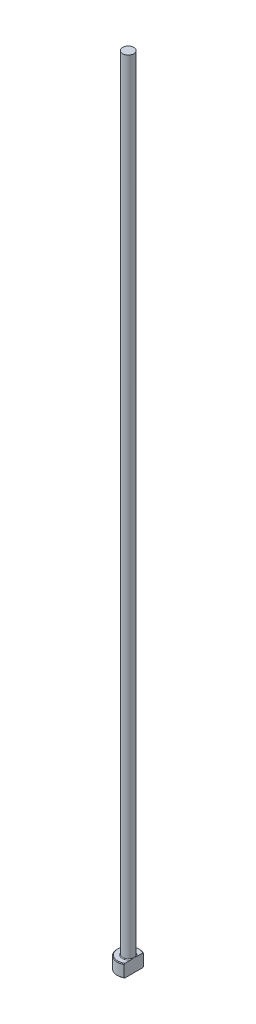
ISO-10303-21;
HEADER;
FILE_DESCRIPTION(('STEP AP214'),'2;1');
FILE_NAME('part.step','',(''),(''),'','','');
FILE_SCHEMA(('AUTOMOTIVE_DESIGN { 1 0 10303 214 1 1 1 1 }'));
ENDSEC;
DATA;
#1=APPLICATION_CONTEXT('core data for automotive mechanical design processes');
#2=APPLICATION_PROTOCOL_DEFINITION('international standard','automotive_design',2000,#1);
#3=PRODUCT_CONTEXT('',#1,'mechanical');
#4=PRODUCT('Part','Part','',(#3));
#5=PRODUCT_RELATED_PRODUCT_CATEGORY('part','',(#4));
#6=PRODUCT_DEFINITION_FORMATION('','',#4);
#7=PRODUCT_DEFINITION_CONTEXT('part definition',#1,'design');
#8=PRODUCT_DEFINITION('design','',#6,#7);
#9=PRODUCT_DEFINITION_SHAPE('','',#8);
#10=(LENGTH_UNIT() NAMED_UNIT(*) SI_UNIT(.MILLI.,.METRE.));
#11=(NAMED_UNIT(*) PLANE_ANGLE_UNIT() SI_UNIT($,.RADIAN.));
#12=(NAMED_UNIT(*) SI_UNIT($,.STERADIAN.) SOLID_ANGLE_UNIT());
#13=UNCERTAINTY_MEASURE_WITH_UNIT(LENGTH_MEASURE(1.E-05),#10,'distance_accuracy_value','');
#14=(GEOMETRIC_REPRESENTATION_CONTEXT(3) GLOBAL_UNCERTAINTY_ASSIGNED_CONTEXT((#13)) GLOBAL_UNIT_ASSIGNED_CONTEXT((#10,
#11,#12)) REPRESENTATION_CONTEXT('',''));
#15=CARTESIAN_POINT('',(0.,0.,0.));
#16=DIRECTION('',(0.,0.,1.));
#17=DIRECTION('',(1.,0.,0.));
#18=AXIS2_PLACEMENT_3D('',#15,#16,#17);
#19=CARTESIAN_POINT('',(0.,0.,0.));
#20=DIRECTION('',(0.,-1.,0.));
#21=DIRECTION('',(0.,0.,-1.));
#22=AXIS2_PLACEMENT_3D('',#19,#20,#21);
#23=PLANE('',#22);
#24=CARTESIAN_POINT('',(0.,0.,0.));
#25=DIRECTION('',(0.,-1.,0.));
#26=DIRECTION('',(0.,0.,-1.));
#27=AXIS2_PLACEMENT_3D('',#24,#25,#26);
#28=CIRCLE('',#27,3.29999999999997);
#29=CARTESIAN_POINT('',(1.74999999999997,0.,2.79776696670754));
#30=VERTEX_POINT('',#29);
#31=CARTESIAN_POINT('',(1.74999999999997,0.,-2.79776696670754));
#32=VERTEX_POINT('',#31);
#33=EDGE_CURVE('E98',#30,#32,#28,.T.);
#34=ORIENTED_EDGE('',*,*,#33,.T.);
#35=DIRECTION('',(0.,0.,1.));
#36=VECTOR('',#35,1.);
#37=CARTESIAN_POINT('',(1.74999999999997,0.,3.03108891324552));
#38=LINE('',#37,#36);
#39=EDGE_CURVE('E83',#32,#30,#38,.T.);
#40=ORIENTED_EDGE('',*,*,#39,.T.);
#41=EDGE_LOOP('',(#34,#40));
#42=FACE_BOUND('',#41,.T.);
#43=ADVANCED_FACE('F32',(#42),#23,.T.);
#44=CARTESIAN_POINT('',(0.,259.958771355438,0.));
#45=DIRECTION('',(0.,1.,0.));
#46=DIRECTION('',(0.,0.,1.));
#47=AXIS2_PLACEMENT_3D('',#44,#45,#46);
#48=CYLINDRICAL_SURFACE('',#47,3.49999999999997);
#49=CARTESIAN_POINT('',(0.,3.79999999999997,0.));
#50=DIRECTION('',(0.,1.,0.));
#51=DIRECTION('',(0.,0.,1.));
#52=AXIS2_PLACEMENT_3D('',#49,#50,#51);
#53=CIRCLE('',#52,3.49999999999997);
#54=CARTESIAN_POINT('',(1.74999999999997,3.79999999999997,3.03108891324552));
#55=VERTEX_POINT('',#54);
#56=CARTESIAN_POINT('',(1.74999999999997,3.79999999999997,-3.03108891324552));
#57=VERTEX_POINT('',#56);
#58=EDGE_CURVE('E104',#55,#57,#53,.F.);
#59=ORIENTED_EDGE('',*,*,#58,.T.);
#60=DIRECTION('',(0.,-1.,0.));
#61=VECTOR('',#60,1.);
#62=CARTESIAN_POINT('',(1.74999999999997,250.,-3.03108891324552));
#63=LINE('',#62,#61);
#64=CARTESIAN_POINT('',(1.74999999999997,0.199999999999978,-3.03108891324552));
#65=VERTEX_POINT('',#64);
#66=EDGE_CURVE('E183',#57,#65,#63,.T.);
#67=ORIENTED_EDGE('',*,*,#66,.T.);
#68=CARTESIAN_POINT('',(0.,0.199999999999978,0.));
#69=DIRECTION('',(0.,-1.,0.));
#70=DIRECTION('',(0.,0.,-1.));
#71=AXIS2_PLACEMENT_3D('',#68,#69,#70);
#72=CIRCLE('',#71,3.49999999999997);
#73=CARTESIAN_POINT('',(1.74999999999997,0.199999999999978,3.03108891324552));
#74=VERTEX_POINT('',#73);
#75=EDGE_CURVE('E100',#65,#74,#72,.F.);
#76=ORIENTED_EDGE('',*,*,#75,.T.);
#77=DIRECTION('',(0.,-1.,0.));
#78=VECTOR('',#77,1.);
#79=CARTESIAN_POINT('',(1.74999999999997,250.,3.03108891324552));
#80=LINE('',#79,#78);
#81=EDGE_CURVE('E93',#55,#74,#80,.T.);
#82=ORIENTED_EDGE('',*,*,#81,.F.);
#83=EDGE_LOOP('',(#59,#67,#76,#82));
#84=FACE_BOUND('',#83,.T.);
#85=ADVANCED_FACE('F158',(#84),#48,.T.);
#86=CARTESIAN_POINT('',(-3.49999999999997,4.,0.));
#87=DIRECTION('',(0.,1.,0.));
#88=DIRECTION('',(0.,0.,1.));
#89=AXIS2_PLACEMENT_3D('',#86,#87,#88);
#90=PLANE('',#89);
#91=CARTESIAN_POINT('',(0.,4.,0.));
#92=DIRECTION('',(0.,1.,0.));
#93=DIRECTION('',(0.,0.,1.));
#94=AXIS2_PLACEMENT_3D('',#91,#92,#93);
#95=CIRCLE('',#94,3.29999999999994);
#96=CARTESIAN_POINT('',(1.74999999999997,4.,-2.79776696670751));
#97=VERTEX_POINT('',#96);
#98=CARTESIAN_POINT('',(1.74999999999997,4.,2.79776696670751));
#99=VERTEX_POINT('',#98);
#100=EDGE_CURVE('E178',#97,#99,#95,.T.);
#101=ORIENTED_EDGE('',*,*,#100,.T.);
#102=DIRECTION('',(0.,0.,-1.));
#103=VECTOR('',#102,1.);
#104=CARTESIAN_POINT('',(1.74999999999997,4.,0.));
#105=LINE('',#104,#103);
#106=CARTESIAN_POINT('',(1.74999999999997,3.99999999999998,0.860232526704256));
#107=VERTEX_POINT('',#106);
#108=EDGE_CURVE('E57',#99,#107,#105,.T.);
#109=ORIENTED_EDGE('',*,*,#108,.T.);
#110=CARTESIAN_POINT('',(0.,4.,0.));
#111=DIRECTION('',(0.,1.,0.));
#112=DIRECTION('',(0.,0.,1.));
#113=AXIS2_PLACEMENT_3D('',#110,#111,#112);
#114=CIRCLE('',#113,1.94999999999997);
#115=CARTESIAN_POINT('',(1.74999999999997,3.99999999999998,-0.860232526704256));
#116=VERTEX_POINT('',#115);
#117=EDGE_CURVE('E107',#107,#116,#114,.F.);
#118=ORIENTED_EDGE('',*,*,#117,.T.);
#119=EDGE_CURVE('E136',#116,#97,#105,.T.);
#120=ORIENTED_EDGE('',*,*,#119,.T.);
#121=EDGE_LOOP('',(#101,#109,#118,#120));
#122=FACE_BOUND('',#121,.T.);
#123=ADVANCED_FACE('F147',(#122),#90,.T.);
#124=CARTESIAN_POINT('',(0.,4.,0.));
#125=DIRECTION('',(0.,-1.,0.));
#126=DIRECTION('',(0.,0.,-1.));
#127=AXIS2_PLACEMENT_3D('',#124,#125,#126);
#128=CONICAL_SURFACE('',#127,3.29999999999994,0.785398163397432);
#129=ORIENTED_EDGE('',*,*,#58,.F.);
#130=CARTESIAN_POINT('',(1.74999999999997,0.403691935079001,6.67057455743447));
#131=CARTESIAN_POINT('',(1.74999999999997,0.549902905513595,6.5194071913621));
#132=CARTESIAN_POINT('',(1.74999999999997,0.695956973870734,6.36808756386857));
#133=CARTESIAN_POINT('',(1.74999999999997,0.987658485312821,6.06505321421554));
#134=CARTESIAN_POINT('',(1.74999999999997,1.13330592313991,5.91333848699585));
#135=CARTESIAN_POINT('',(1.74999999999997,1.42417201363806,5.60934946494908));
#136=CARTESIAN_POINT('',(1.74999999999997,1.5693904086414,5.45707492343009));
#137=CARTESIAN_POINT('',(1.74999999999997,1.85918520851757,5.15191761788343));
#138=CARTESIAN_POINT('',(1.74999999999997,2.00376161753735,4.99903485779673));
#139=CARTESIAN_POINT('',(1.74999999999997,2.28922437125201,4.69552747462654));
#140=CARTESIAN_POINT('',(1.74999999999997,2.43012702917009,4.54491820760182));
#141=CARTESIAN_POINT('',(1.74999999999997,2.71087777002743,4.24272028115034));
#142=CARTESIAN_POINT('',(1.74999999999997,2.85072585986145,4.09113162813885));
#143=CARTESIAN_POINT('',(1.74999999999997,3.12895853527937,3.78667524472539));
#144=CARTESIAN_POINT('',(1.74999999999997,3.26734342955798,3.63380779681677));
#145=CARTESIAN_POINT('',(1.74999999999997,3.54209958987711,3.32627683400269));
#146=CARTESIAN_POINT('',(1.74999999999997,3.67847093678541,3.1716133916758));
#147=CARTESIAN_POINT('',(1.74999999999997,3.89617282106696,2.91990258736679));
#148=CARTESIAN_POINT('',(1.74999999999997,3.97843114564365,2.82365864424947));
#149=CARTESIAN_POINT('',(1.74999999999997,4.14148360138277,2.62991861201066));
#150=CARTESIAN_POINT('',(1.74999999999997,4.22227758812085,2.53242240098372));
#151=CARTESIAN_POINT('',(1.74999999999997,4.38274452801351,2.33479038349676));
#152=CARTESIAN_POINT('',(1.74999999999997,4.46239661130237,2.23463757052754));
#153=CARTESIAN_POINT('',(1.74999999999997,4.61891495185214,2.03220225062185));
#154=CARTESIAN_POINT('',(1.74999999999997,4.69578187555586,1.9299202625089));
#155=CARTESIAN_POINT('',(1.74999999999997,4.8466965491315,1.72090511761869));
#156=CARTESIAN_POINT('',(1.74999999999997,4.92068375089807,1.61412795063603));
#157=CARTESIAN_POINT('',(1.74999999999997,5.06269616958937,1.396383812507));
#158=CARTESIAN_POINT('',(1.74999999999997,5.13071318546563,1.28541136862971));
#159=CARTESIAN_POINT('',(1.74999999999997,5.22516490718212,1.11561175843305));
#160=CARTESIAN_POINT('',(1.74999999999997,5.25522351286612,1.05881631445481));
#161=CARTESIAN_POINT('',(1.74999999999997,5.31237042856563,0.943756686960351));
#162=CARTESIAN_POINT('',(1.74999999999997,5.33945819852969,0.885492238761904));
#163=CARTESIAN_POINT('',(1.74999999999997,5.41499290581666,0.708569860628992));
#164=CARTESIAN_POINT('',(1.74999999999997,5.45796078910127,0.587356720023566));
#165=CARTESIAN_POINT('',(1.74999999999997,5.50447230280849,0.405622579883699));
#166=CARTESIAN_POINT('',(1.74999999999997,5.51680920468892,0.347327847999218));
#167=CARTESIAN_POINT('',(1.74999999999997,5.53592536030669,0.229813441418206));
#168=CARTESIAN_POINT('',(1.74999999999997,5.54270510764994,0.17059384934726));
#169=CARTESIAN_POINT('',(1.74999999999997,5.55022681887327,0.0519516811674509));
#170=CARTESIAN_POINT('',(1.74999999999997,5.55098747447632,-0.00746969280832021));
#171=CARTESIAN_POINT('',(1.74999999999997,5.54646541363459,-0.126082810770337));
#172=CARTESIAN_POINT('',(1.74999999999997,5.54118219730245,-0.185274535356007));
#173=CARTESIAN_POINT('',(1.74999999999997,5.52501178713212,-0.302357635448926));
#174=CARTESIAN_POINT('',(1.74999999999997,5.51417270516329,-0.360255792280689));
#175=CARTESIAN_POINT('',(1.74999999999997,5.48756668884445,-0.474896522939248));
#176=CARTESIAN_POINT('',(1.74999999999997,5.47179916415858,-0.531638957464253));
#177=CARTESIAN_POINT('',(1.74999999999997,5.43599695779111,-0.644103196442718));
#178=CARTESIAN_POINT('',(1.74999999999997,5.41593824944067,-0.699817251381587));
#179=CARTESIAN_POINT('',(1.74999999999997,5.37235913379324,-0.809843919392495));
#180=CARTESIAN_POINT('',(1.74999999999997,5.3488394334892,-0.864156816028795));
#181=CARTESIAN_POINT('',(1.74999999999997,5.27385837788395,-1.02562379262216));
#182=CARTESIAN_POINT('',(1.74999999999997,5.21814894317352,-1.13079943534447));
#183=CARTESIAN_POINT('',(1.74999999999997,5.0993572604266,-1.33694307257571));
#184=CARTESIAN_POINT('',(1.74999999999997,5.03626572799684,-1.43790554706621));
#185=CARTESIAN_POINT('',(1.74999999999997,4.9049024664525,-1.63694628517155));
#186=CARTESIAN_POINT('',(1.74999999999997,4.83661129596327,-1.73501160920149));
#187=CARTESIAN_POINT('',(1.74999999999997,4.69663576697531,-1.9285911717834));
#188=CARTESIAN_POINT('',(1.74999999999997,4.62495312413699,-2.0241066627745));
#189=CARTESIAN_POINT('',(1.74999999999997,4.47817312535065,-2.21448054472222));
#190=CARTESIAN_POINT('',(1.74999999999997,4.40304324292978,-2.30931373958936));
#191=CARTESIAN_POINT('',(1.74999999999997,4.25092223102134,-2.49748629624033));
#192=CARTESIAN_POINT('',(1.74999999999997,4.17393090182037,-2.59082549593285));
#193=CARTESIAN_POINT('',(1.74999999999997,4.01873588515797,-2.776102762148));
#194=CARTESIAN_POINT('',(1.74999999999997,3.94053559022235,-2.86804367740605));
#195=CARTESIAN_POINT('',(1.74999999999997,3.78305359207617,-3.05099558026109));
#196=CARTESIAN_POINT('',(1.74999999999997,3.70377186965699,-3.14200655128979));
#197=CARTESIAN_POINT('',(1.74999999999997,3.49177755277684,-3.38307713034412));
#198=CARTESIAN_POINT('',(1.74999999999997,3.35832098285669,-3.53248201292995));
#199=CARTESIAN_POINT('',(1.74999999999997,3.08977689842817,-3.82982116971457));
#200=CARTESIAN_POINT('',(1.74999999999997,2.95468933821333,-3.97775540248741));
#201=CARTESIAN_POINT('',(1.74999999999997,2.68319766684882,-4.27266697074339));
#202=CARTESIAN_POINT('',(1.74999999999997,2.54679243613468,-4.41964327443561));
#203=CARTESIAN_POINT('',(1.74999999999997,2.2730859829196,-4.71275937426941));
#204=CARTESIAN_POINT('',(1.74999999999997,2.13578475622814,-4.85889916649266));
#205=CARTESIAN_POINT('',(1.74999999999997,1.73418398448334,-5.28435414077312));
#206=CARTESIAN_POINT('',(1.74999999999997,1.46897142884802,-5.56280727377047));
#207=CARTESIAN_POINT('',(1.74999999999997,1.07010496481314,-5.97918348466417));
#208=CARTESIAN_POINT('',(1.74999999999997,0.937049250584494,-6.11768155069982));
#209=CARTESIAN_POINT('',(1.74999999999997,0.67060477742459,-6.39435480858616));
#210=CARTESIAN_POINT('',(1.74999999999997,0.537216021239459,-6.53253000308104));
#211=CARTESIAN_POINT('',(1.74999999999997,0.403691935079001,-6.67057455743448));
#212=B_SPLINE_CURVE_WITH_KNOTS('',3,(#130,#131,#132,#133,#134,#135,#136,#137,#138,#139,#140,
#141,#142,#143,#144,#145,#146,#147,#148,#149,#150,#151,#152,#153,#154,#155,#156,#157,#158,#159,
#160,#161,#162,#163,#164,#165,#166,#167,#168,#169,#170,#171,#172,#173,#174,#175,#176,#177,#178,
#179,#180,#181,#182,#183,#184,#185,#186,#187,#188,#189,#190,#191,#192,#193,#194,#195,#196,#197,
#198,#199,#200,#201,#202,#203,#204,#205,#206,#207,#208,#209,#210,#211),.UNSPECIFIED.,.F.,.F.,(4,
2,2,2,2,2,2,2,2,2,2,2,2,2,2,2,2,2,2,2,2,2,2,2,2,2,2,2,2,2,2,2,2,2,2,2,2,2,2,2,4),(0.,
0.630922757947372,1.26185363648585,1.89310749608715,2.52435727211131,3.14308654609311,
3.76181177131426,4.38040374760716,4.9989708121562,5.37878108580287,5.75862861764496,
6.1424903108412,6.52625953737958,6.91585739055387,7.30598230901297,7.49867618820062,
7.69140503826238,8.07538783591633,8.25392686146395,8.43245002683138,8.610418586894,
8.7884018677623,8.96486927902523,9.1413578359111,9.31886171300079,9.49632938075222,
9.85286274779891,10.209849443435,10.5682434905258,10.9264581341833,11.2893876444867,
11.6523562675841,12.0144447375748,12.3765396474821,12.9775131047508,13.5785034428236,
14.1800594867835,14.7816183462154,15.9352370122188,16.5114050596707,17.087568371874),.UNSPECIFIED.);
#213=EDGE_CURVE('E135',#55,#99,#212,.T.);
#214=ORIENTED_EDGE('',*,*,#213,.T.);
#215=ORIENTED_EDGE('',*,*,#100,.F.);
#216=EDGE_CURVE('E127',#97,#57,#212,.T.);
#217=ORIENTED_EDGE('',*,*,#216,.T.);
#218=EDGE_LOOP('',(#129,#214,#215,#217));
#219=FACE_BOUND('',#218,.T.);
#220=ADVANCED_FACE('F143',(#219),#128,.T.);
#221=CARTESIAN_POINT('',(0.,0.199999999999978,0.));
#222=DIRECTION('',(0.,1.,0.));
#223=DIRECTION('',(0.,0.,1.));
#224=AXIS2_PLACEMENT_3D('',#221,#222,#223);
#225=CONICAL_SURFACE('',#224,3.49999999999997,0.785398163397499);
#226=ORIENTED_EDGE('',*,*,#75,.F.);
#227=CARTESIAN_POINT('',(1.74999999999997,3.59630806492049,-6.67057455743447));
#228=CARTESIAN_POINT('',(1.74999999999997,3.45009709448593,-6.51940719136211));
#229=CARTESIAN_POINT('',(1.74999999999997,3.30404302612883,-6.36808756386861));
#230=CARTESIAN_POINT('',(1.74999999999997,3.01234151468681,-6.0650532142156));
#231=CARTESIAN_POINT('',(1.74999999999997,2.86669407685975,-5.91333848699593));
#232=CARTESIAN_POINT('',(1.74999999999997,2.57582798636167,-5.60934946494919));
#233=CARTESIAN_POINT('',(1.74999999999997,2.43060959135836,-5.45707492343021));
#234=CARTESIAN_POINT('',(1.74999999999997,2.14081479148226,-5.15191761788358));
#235=CARTESIAN_POINT('',(1.74999999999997,1.99623838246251,-4.9990348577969));
#236=CARTESIAN_POINT('',(1.74999999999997,1.71077562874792,-4.69552747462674));
#237=CARTESIAN_POINT('',(1.74999999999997,1.56987297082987,-4.54491820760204));
#238=CARTESIAN_POINT('',(1.74999999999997,1.28912222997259,-4.24272028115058));
#239=CARTESIAN_POINT('',(1.74999999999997,1.1492741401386,-4.0911316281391));
#240=CARTESIAN_POINT('',(1.74999999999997,0.871041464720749,-3.78667524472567));
#241=CARTESIAN_POINT('',(1.74999999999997,0.732656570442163,-3.63380779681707));
#242=CARTESIAN_POINT('',(1.74999999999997,0.457900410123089,-3.32627683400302));
#243=CARTESIAN_POINT('',(1.74999999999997,0.321529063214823,-3.17161339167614));
#244=CARTESIAN_POINT('',(1.74999999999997,0.103827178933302,-2.91990258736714));
#245=CARTESIAN_POINT('',(1.74999999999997,0.021568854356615,-2.82365864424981));
#246=CARTESIAN_POINT('',(1.74999999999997,-0.141483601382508,-2.62991861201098));
#247=CARTESIAN_POINT('',(1.74999999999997,-0.222277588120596,-2.53242240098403));
#248=CARTESIAN_POINT('',(1.74999999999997,-0.382744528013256,-2.33479038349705));
#249=CARTESIAN_POINT('',(1.74999999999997,-0.462396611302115,-2.23463757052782));
#250=CARTESIAN_POINT('',(1.74999999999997,-0.618914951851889,-2.03220225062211));
#251=CARTESIAN_POINT('',(1.74999999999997,-0.695781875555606,-1.92992026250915));
#252=CARTESIAN_POINT('',(1.74999999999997,-0.84669654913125,-1.72090511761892));
#253=CARTESIAN_POINT('',(1.74999999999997,-0.920683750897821,-1.61412795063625));
#254=CARTESIAN_POINT('',(1.74999999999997,-1.06269616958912,-1.39638381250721));
#255=CARTESIAN_POINT('',(1.74999999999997,-1.13071318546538,-1.28541136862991));
#256=CARTESIAN_POINT('',(1.74999999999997,-1.22516490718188,-1.11561175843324));
#257=CARTESIAN_POINT('',(1.74999999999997,-1.25522351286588,-1.058816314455));
#258=CARTESIAN_POINT('',(1.74999999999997,-1.31237042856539,-0.943756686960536));
#259=CARTESIAN_POINT('',(1.74999999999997,-1.33945819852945,-0.885492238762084));
#260=CARTESIAN_POINT('',(1.74999999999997,-1.41499290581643,-0.708569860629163));
#261=CARTESIAN_POINT('',(1.74999999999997,-1.45796078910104,-0.587356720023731));
#262=CARTESIAN_POINT('',(1.74999999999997,-1.50447230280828,-0.405622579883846));
#263=CARTESIAN_POINT('',(1.74999999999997,-1.51680920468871,-0.347327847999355));
#264=CARTESIAN_POINT('',(1.74999999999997,-1.53592536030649,-0.229813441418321));
#265=CARTESIAN_POINT('',(1.74999999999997,-1.54270510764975,-0.170593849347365));
#266=CARTESIAN_POINT('',(1.74999999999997,-1.55022681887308,-0.0519516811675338));
#267=CARTESIAN_POINT('',(1.74999999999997,-1.55098747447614,0.0074696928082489));
#268=CARTESIAN_POINT('',(1.74999999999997,-1.54646541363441,0.126082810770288));
#269=CARTESIAN_POINT('',(1.74999999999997,-1.54118219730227,0.185274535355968));
#270=CARTESIAN_POINT('',(1.74999999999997,-1.52501178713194,0.30235763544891));
#271=CARTESIAN_POINT('',(1.74999999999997,-1.51417270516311,0.360255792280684));
#272=CARTESIAN_POINT('',(1.74999999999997,-1.48756668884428,0.474896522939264));
#273=CARTESIAN_POINT('',(1.74999999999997,-1.4717991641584,0.531638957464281));
#274=CARTESIAN_POINT('',(1.74999999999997,-1.43599695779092,0.644103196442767));
#275=CARTESIAN_POINT('',(1.74999999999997,-1.41593824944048,0.699817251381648));
#276=CARTESIAN_POINT('',(1.74999999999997,-1.37235913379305,0.809843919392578));
#277=CARTESIAN_POINT('',(1.74999999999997,-1.348839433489,0.864156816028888));
#278=CARTESIAN_POINT('',(1.74999999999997,-1.27385837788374,1.02562379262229));
#279=CARTESIAN_POINT('',(1.74999999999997,-1.21814894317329,1.13079943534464));
#280=CARTESIAN_POINT('',(1.74999999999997,-1.09935726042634,1.33694307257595));
#281=CARTESIAN_POINT('',(1.74999999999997,-1.03626572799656,1.43790554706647));
#282=CARTESIAN_POINT('',(1.74999999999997,-0.904902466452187,1.63694628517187));
#283=CARTESIAN_POINT('',(1.74999999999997,-0.836611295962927,1.73501160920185));
#284=CARTESIAN_POINT('',(1.74999999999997,-0.696635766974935,1.92859117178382));
#285=CARTESIAN_POINT('',(1.74999999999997,-0.62495312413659,2.02410666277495));
#286=CARTESIAN_POINT('',(1.74999999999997,-0.478173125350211,2.21448054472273));
#287=CARTESIAN_POINT('',(1.74999999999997,-0.403043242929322,2.30931373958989));
#288=CARTESIAN_POINT('',(1.74999999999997,-0.250922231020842,2.49748629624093));
#289=CARTESIAN_POINT('',(1.74999999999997,-0.173930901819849,2.59082549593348));
#290=CARTESIAN_POINT('',(1.74999999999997,-0.0187358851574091,2.77610276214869));
#291=CARTESIAN_POINT('',(1.74999999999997,0.0594644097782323,2.86804367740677));
#292=CARTESIAN_POINT('',(1.74999999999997,0.216946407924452,3.05099558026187));
#293=CARTESIAN_POINT('',(1.74999999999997,0.296228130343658,3.14200655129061));
#294=CARTESIAN_POINT('',(1.74999999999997,0.508222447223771,3.38307713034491));
#295=CARTESIAN_POINT('',(1.74999999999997,0.641679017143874,3.5324820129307));
#296=CARTESIAN_POINT('',(1.74999999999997,0.910223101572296,3.82982116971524));
#297=CARTESIAN_POINT('',(1.74999999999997,1.04531066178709,3.97775540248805));
#298=CARTESIAN_POINT('',(1.74999999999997,1.31680233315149,4.27266697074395));
#299=CARTESIAN_POINT('',(1.74999999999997,1.45320756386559,4.41964327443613));
#300=CARTESIAN_POINT('',(1.74999999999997,1.72691401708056,4.71275937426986));
#301=CARTESIAN_POINT('',(1.74999999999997,1.86421524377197,4.85889916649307));
#302=CARTESIAN_POINT('',(1.74999999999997,2.26581601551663,5.28435414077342));
#303=CARTESIAN_POINT('',(1.74999999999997,2.53102857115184,5.56280727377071));
#304=CARTESIAN_POINT('',(1.74999999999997,2.92989503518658,5.97918348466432));
#305=CARTESIAN_POINT('',(1.74999999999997,3.06295074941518,6.11768155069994));
#306=CARTESIAN_POINT('',(1.74999999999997,3.329395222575,6.39435480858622));
#307=CARTESIAN_POINT('',(1.74999999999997,3.46278397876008,6.53253000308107));
#308=CARTESIAN_POINT('',(1.74999999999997,3.59630806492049,6.67057455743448));
#309=B_SPLINE_CURVE_WITH_KNOTS('',3,(#227,#228,#229,#230,#231,#232,#233,#234,#235,#236,#237,
#238,#239,#240,#241,#242,#243,#244,#245,#246,#247,#248,#249,#250,#251,#252,#253,#254,#255,#256,
#257,#258,#259,#260,#261,#262,#263,#264,#265,#266,#267,#268,#269,#270,#271,#272,#273,#274,#275,
#276,#277,#278,#279,#280,#281,#282,#283,#284,#285,#286,#287,#288,#289,#290,#291,#292,#293,#294,
#295,#296,#297,#298,#299,#300,#301,#302,#303,#304,#305,#306,#307,#308),.UNSPECIFIED.,.F.,.F.,(4,
2,2,2,2,2,2,2,2,2,2,2,2,2,2,2,2,2,2,2,2,2,2,2,2,2,2,2,2,2,2,2,2,2,2,2,2,2,2,2,4),(0.,
0.630922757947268,1.26185363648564,1.89310749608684,2.52435727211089,3.1430865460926,
3.76181177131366,4.38040374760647,4.99897081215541,5.37878108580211,5.75862861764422,
6.14249031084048,6.52625953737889,6.9158573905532,7.30598230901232,7.49867618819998,
7.69140503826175,8.07538783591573,8.25392686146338,8.43245002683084,8.6104185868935,
8.78840186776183,8.9648692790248,9.14135783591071,9.31886171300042,9.49632938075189,
9.85286274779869,10.2098494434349,10.5682434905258,10.9264581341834,11.2893876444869,
11.6523562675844,12.0144447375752,12.3765396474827,12.9775131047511,13.5785034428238,
14.1800594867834,14.7816183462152,15.9352370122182,16.51140505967,17.0875683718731),.UNSPECIFIED.);
#310=EDGE_CURVE('E86',#65,#32,#309,.T.);
#311=ORIENTED_EDGE('',*,*,#310,.T.);
#312=ORIENTED_EDGE('',*,*,#33,.F.);
#313=EDGE_CURVE('E89',#30,#74,#309,.T.);
#314=ORIENTED_EDGE('',*,*,#313,.T.);
#315=EDGE_LOOP('',(#226,#311,#312,#314));
#316=FACE_BOUND('',#315,.T.);
#317=ADVANCED_FACE('F97',(#316),#225,.T.);
#318=CARTESIAN_POINT('',(0.,4.19999999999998,0.));
#319=DIRECTION('',(0.,1.,0.));
#320=DIRECTION('',(0.,0.,1.));
#321=AXIS2_PLACEMENT_3D('',#318,#319,#320);
#322=TOROIDAL_SURFACE('',#321,1.94999999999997,0.2);
#323=CARTESIAN_POINT('',(1.74999999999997,4.19999999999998,0.));
#324=CARTESIAN_POINT('',(1.74999999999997,4.2000005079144,9.3867964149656E-11));
#325=CARTESIAN_POINT('',(1.74999999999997,4.20000101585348,-1.34501103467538E-07));
#326=CARTESIAN_POINT('',(1.74999999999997,4.20000198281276,-5.41283480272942E-07));
#327=CARTESIAN_POINT('',(1.74999999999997,4.20000243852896,-8.19487716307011E-07));
#328=CARTESIAN_POINT('',(1.74999999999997,4.2000033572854,-1.4843911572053E-06));
#329=CARTESIAN_POINT('',(1.74999999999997,4.20000381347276,-1.8805263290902E-06));
#330=CARTESIAN_POINT('',(1.74999999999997,4.2000046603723,-2.72280867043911E-06));
#331=CARTESIAN_POINT('',(1.74999999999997,4.20000505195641,-3.16812554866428E-06));
#332=CARTESIAN_POINT('',(1.74999999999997,4.20000641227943,-4.80772283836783E-06));
#333=CARTESIAN_POINT('',(1.74999999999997,4.20000730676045,-6.06508173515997E-06));
#334=CARTESIAN_POINT('',(1.74999999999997,4.20000885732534,-8.62364313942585E-06));
#335=CARTESIAN_POINT('',(1.74999999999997,4.2000095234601,-9.91907771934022E-06));
#336=CARTESIAN_POINT('',(1.74999999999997,4.20001212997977,-1.51310766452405E-05));
#337=CARTESIAN_POINT('',(1.74999999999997,4.20001395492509,-1.91092656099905E-05));
#338=CARTESIAN_POINT('',(1.74999999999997,4.200016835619,-2.68327807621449E-05));
#339=CARTESIAN_POINT('',(1.74999999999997,4.20001795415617,-3.05551301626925E-05));
#340=CARTESIAN_POINT('',(1.74999999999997,4.20002287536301,-4.68261375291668E-05));
#341=CARTESIAN_POINT('',(1.74999999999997,4.20002674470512,-5.93446279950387E-05));
#342=CARTESIAN_POINT('',(1.74999999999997,4.20003278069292,-8.25255943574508E-05));
#343=CARTESIAN_POINT('',(1.74999999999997,4.2000351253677,-9.31393224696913E-05));
#344=CARTESIAN_POINT('',(1.74999999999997,4.20005413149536,-0.000171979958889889));
#345=CARTESIAN_POINT('',(1.74999999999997,4.20007897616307,-0.000237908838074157));
#346=CARTESIAN_POINT('',(1.74999999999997,4.20017305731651,-0.000496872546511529));
#347=CARTESIAN_POINT('',(1.74999999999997,4.20023617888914,-0.000691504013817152));
#348=CARTESIAN_POINT('',(1.74999999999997,4.20048774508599,-0.00145613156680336));
#349=CARTESIAN_POINT('',(1.74999999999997,4.20068259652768,-0.00202450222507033));
#350=CARTESIAN_POINT('',(1.74999999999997,4.20148279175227,-0.00436941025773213));
#351=CARTESIAN_POINT('',(1.74999999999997,4.20208089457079,-0.00614773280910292));
#352=CARTESIAN_POINT('',(1.74999999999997,4.20853845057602,-0.0253339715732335));
#353=CARTESIAN_POINT('',(1.74999999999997,4.21443574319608,-0.0427328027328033));
#354=CARTESIAN_POINT('',(1.74999999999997,4.22594434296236,-0.076884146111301));
#355=CARTESIAN_POINT('',(1.74999999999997,4.23155796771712,-0.0936359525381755));
#356=CARTESIAN_POINT('',(1.74999999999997,4.24339960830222,-0.129193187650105));
#357=CARTESIAN_POINT('',(1.74999999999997,4.24961959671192,-0.148001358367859));
#358=CARTESIAN_POINT('',(1.74999999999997,4.26199268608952,-0.185858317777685));
#359=CARTESIAN_POINT('',(1.74999999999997,4.26814439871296,-0.204907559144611));
#360=CARTESIAN_POINT('',(1.74999999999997,4.28302129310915,-0.251728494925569));
#361=CARTESIAN_POINT('',(1.74999999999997,4.2916463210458,-0.279532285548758));
#362=CARTESIAN_POINT('',(1.74999999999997,4.30815507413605,-0.334622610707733));
#363=CARTESIAN_POINT('',(1.74999999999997,4.3160517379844,-0.36190524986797));
#364=CARTESIAN_POINT('',(1.74999999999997,4.33270110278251,-0.422187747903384));
#365=CARTESIAN_POINT('',(1.74999999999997,4.34130455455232,-0.455229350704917));
#366=CARTESIAN_POINT('',(1.74999999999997,4.35728256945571,-0.521873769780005));
#367=CARTESIAN_POINT('',(1.74999999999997,4.36464748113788,-0.555478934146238));
#368=CARTESIAN_POINT('',(1.74999999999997,4.37810121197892,-0.625225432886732));
#369=CARTESIAN_POINT('',(1.74999999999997,4.38407559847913,-0.661389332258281));
#370=CARTESIAN_POINT('',(1.74999999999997,4.39348021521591,-0.733973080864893));
#371=CARTESIAN_POINT('',(1.74999999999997,4.39691695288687,-0.77039203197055));
#372=CARTESIAN_POINT('',(1.74999999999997,4.39990626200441,-0.832262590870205));
#373=CARTESIAN_POINT('',(1.74999999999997,4.40032395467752,-0.857670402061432));
#374=CARTESIAN_POINT('',(1.74999999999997,4.39916217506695,-0.908260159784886));
#375=CARTESIAN_POINT('',(1.74999999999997,4.39759783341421,-0.933442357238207));
#376=CARTESIAN_POINT('',(1.74999999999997,4.39129859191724,-0.989903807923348));
#377=CARTESIAN_POINT('',(1.74999999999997,4.38586007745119,-1.02110925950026));
#378=CARTESIAN_POINT('',(1.74999999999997,4.36964168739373,-1.08216800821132));
#379=CARTESIAN_POINT('',(1.74999999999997,4.35888918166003,-1.11202738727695));
#380=CARTESIAN_POINT('',(1.74999999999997,4.33961802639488,-1.14878048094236));
#381=CARTESIAN_POINT('',(1.74999999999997,4.33455492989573,-1.15748014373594));
#382=CARTESIAN_POINT('',(1.74999999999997,4.32351587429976,-1.17429661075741));
#383=CARTESIAN_POINT('',(1.74999999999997,4.31753946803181,-1.18241312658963));
#384=CARTESIAN_POINT('',(1.74999999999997,4.30451428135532,-1.19787793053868));
#385=CARTESIAN_POINT('',(1.74999999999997,4.29745609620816,-1.20521842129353));
#386=CARTESIAN_POINT('',(1.74999999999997,4.28223524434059,-1.21865698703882));
#387=CARTESIAN_POINT('',(1.74999999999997,4.27407476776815,-1.22475746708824));
#388=CARTESIAN_POINT('',(1.74999999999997,4.25920166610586,-1.23370537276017));
#389=CARTESIAN_POINT('',(1.74999999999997,4.25274944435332,-1.23698363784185));
#390=CARTESIAN_POINT('',(1.74999999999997,4.23939659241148,-1.24245066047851));
#391=CARTESIAN_POINT('',(1.74999999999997,4.23249637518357,-1.2446404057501));
#392=CARTESIAN_POINT('',(1.74999999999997,4.21836445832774,-1.24776583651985));
#393=CARTESIAN_POINT('',(1.74999999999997,4.21113087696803,-1.24869317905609));
#394=CARTESIAN_POINT('',(1.74999999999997,4.19661788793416,-1.24917680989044));
#395=CARTESIAN_POINT('',(1.74999999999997,4.18933848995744,-1.2487333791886));
#396=CARTESIAN_POINT('',(1.74999999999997,4.17564813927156,-1.2466228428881));
#397=CARTESIAN_POINT('',(1.74999999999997,4.16921873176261,-1.24507159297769));
#398=CARTESIAN_POINT('',(1.74999999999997,4.1566813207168,-1.24099086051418));
#399=CARTESIAN_POINT('',(1.74999999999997,4.15057343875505,-1.23846101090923));
#400=CARTESIAN_POINT('',(1.74999999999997,4.13656990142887,-1.23147130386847));
#401=CARTESIAN_POINT('',(1.74999999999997,4.12885825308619,-1.22664351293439));
#402=CARTESIAN_POINT('',(1.74999999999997,4.11430996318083,-1.21581214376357));
#403=CARTESIAN_POINT('',(1.74999999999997,4.10747539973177,-1.20980585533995));
#404=CARTESIAN_POINT('',(1.74999999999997,4.09141283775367,-1.19367262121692));
#405=CARTESIAN_POINT('',(1.74999999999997,4.08273353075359,-1.18300273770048));
#406=CARTESIAN_POINT('',(1.74999999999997,4.06710756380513,-1.16049397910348));
#407=CARTESIAN_POINT('',(1.74999999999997,4.06016260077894,-1.14865397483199));
#408=CARTESIAN_POINT('',(1.74999999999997,4.04314403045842,-1.11526045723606));
#409=CARTESIAN_POINT('',(1.74999999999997,4.03452872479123,-1.09297031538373));
#410=CARTESIAN_POINT('',(1.74999999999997,4.02051872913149,-1.04724849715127));
#411=CARTESIAN_POINT('',(1.74999999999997,4.015155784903,-1.02380790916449));
#412=CARTESIAN_POINT('',(1.74999999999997,4.00698483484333,-0.976403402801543));
#413=CARTESIAN_POINT('',(1.74999999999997,4.00418732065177,-0.952437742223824));
#414=CARTESIAN_POINT('',(1.74999999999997,4.00064912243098,-0.904321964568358));
#415=CARTESIAN_POINT('',(1.74999999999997,3.99991269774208,-0.88017156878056));
#416=CARTESIAN_POINT('',(1.74999999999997,4.00019275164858,-0.809643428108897));
#417=CARTESIAN_POINT('',(1.74999999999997,4.00344813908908,-0.763278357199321));
#418=CARTESIAN_POINT('',(1.74999999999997,4.01492484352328,-0.664825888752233));
#419=CARTESIAN_POINT('',(1.74999999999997,4.02376250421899,-0.612819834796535));
#420=CARTESIAN_POINT('',(1.74999999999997,4.04538488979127,-0.508370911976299));
#421=CARTESIAN_POINT('',(1.74999999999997,4.0582587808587,-0.455947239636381));
#422=CARTESIAN_POINT('',(1.74999999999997,4.08196429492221,-0.368604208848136));
#423=CARTESIAN_POINT('',(1.74999999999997,4.09211504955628,-0.333493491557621));
#424=CARTESIAN_POINT('',(1.74999999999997,4.11312724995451,-0.263893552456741));
#425=CARTESIAN_POINT('',(1.74999999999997,4.12397997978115,-0.229401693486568));
#426=CARTESIAN_POINT('',(1.74999999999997,4.14496676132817,-0.164340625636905));
#427=CARTESIAN_POINT('',(1.74999999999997,4.15504975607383,-0.133754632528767));
#428=CARTESIAN_POINT('',(1.74999999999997,4.17587821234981,-0.0714242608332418));
#429=CARTESIAN_POINT('',(1.74999999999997,4.18663395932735,-0.0396831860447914));
#430=CARTESIAN_POINT('',(1.74999999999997,4.19791979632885,-0.00614534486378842));
#431=CARTESIAN_POINT('',(1.74999999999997,4.19851877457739,-0.00436467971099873));
#432=CARTESIAN_POINT('',(1.74999999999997,4.19931918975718,-0.00201922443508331));
#433=CARTESIAN_POINT('',(1.74999999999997,4.19951342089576,-0.00145265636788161));
#434=CARTESIAN_POINT('',(1.74999999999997,4.19976423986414,-0.000690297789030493));
#435=CARTESIAN_POINT('',(1.74999999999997,4.19982721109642,-0.000496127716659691));
#436=CARTESIAN_POINT('',(1.74999999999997,4.19992109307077,-0.000237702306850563));
#437=CARTESIAN_POINT('',(1.74999999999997,4.19994590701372,-0.000171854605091));
#438=CARTESIAN_POINT('',(1.74999999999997,4.19996489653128,-9.3104554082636E-05));
#439=CARTESIAN_POINT('',(1.74999999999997,4.1999672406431,-8.24963339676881E-05));
#440=CARTESIAN_POINT('',(1.74999999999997,4.19997327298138,-5.9327776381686E-05));
#441=CARTESIAN_POINT('',(1.74999999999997,4.19997713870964,-4.68160430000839E-05));
#442=CARTESIAN_POINT('',(1.74999999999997,4.19998205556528,-3.0552584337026E-05));
#443=CARTESIAN_POINT('',(1.74999999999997,4.19998317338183,-2.68310311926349E-05));
#444=CARTESIAN_POINT('',(1.74999999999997,4.19998605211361,-1.91090651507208E-05));
#445=CARTESIAN_POINT('',(1.74999999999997,4.1999878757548,-1.51315954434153E-05));
#446=CARTESIAN_POINT('',(1.74999999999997,4.19999048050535,-9.92029976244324E-06));
#447=CARTESIAN_POINT('',(1.74999999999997,4.19999114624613,-8.62492595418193E-06));
#448=CARTESIAN_POINT('',(1.74999999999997,4.19999269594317,-6.06641158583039E-06));
#449=CARTESIAN_POINT('',(1.74999999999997,4.19999358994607,-4.80903338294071E-06));
#450=CARTESIAN_POINT('',(1.74999999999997,4.19999494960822,-3.1693219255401E-06));
#451=CARTESIAN_POINT('',(1.74999999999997,4.19999534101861,-2.7239538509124E-06));
#452=CARTESIAN_POINT('',(1.74999999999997,4.19999618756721,-1.88153783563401E-06));
#453=CARTESIAN_POINT('',(1.74999999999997,4.19999664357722,-1.48531960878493E-06));
#454=CARTESIAN_POINT('',(1.74999999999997,4.19999756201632,-8.20216876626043E-07));
#455=CARTESIAN_POINT('',(1.74999999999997,4.19999801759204,-5.41901820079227E-07));
#456=CARTESIAN_POINT('',(1.74999999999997,4.19999898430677,-1.34847130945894E-07));
#457=CARTESIAN_POINT('',(1.74999999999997,4.19999949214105,-9.38577104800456E-11));
#458=CARTESIAN_POINT('',(1.74999999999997,4.19999999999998,0.));
#459=B_SPLINE_CURVE_WITH_KNOTS('',3,(#323,#324,#325,#326,#327,#328,#329,#330,#331,#332,#333,
#334,#335,#336,#337,#338,#339,#340,#341,#342,#343,#344,#345,#346,#347,#348,#349,#350,#351,#352,
#353,#354,#355,#356,#357,#358,#359,#360,#361,#362,#363,#364,#365,#366,#367,#368,#369,#370,#371,
#372,#373,#374,#375,#376,#377,#378,#379,#380,#381,#382,#383,#384,#385,#386,#387,#388,#389,#390,
#391,#392,#393,#394,#395,#396,#397,#398,#399,#400,#401,#402,#403,#404,#405,#406,#407,#408,#409,
#410,#411,#412,#413,#414,#415,#416,#417,#418,#419,#420,#421,#422,#423,#424,#425,#426,#427,#428,
#429,#430,#431,#432,#433,#434,#435,#436,#437,#438,#439,#440,#441,#442,#443,#444,#445,#446,#447,
#448,#449,#450,#451,#452,#453,#454,#455,#456,#457,#458),.UNSPECIFIED.,.T.,.F.,(4,2,2,2,2,2,2,2,
2,2,2,2,2,2,2,2,2,2,2,2,2,2,2,2,2,2,2,2,2,2,2,2,2,2,2,2,2,2,2,2,2,2,2,2,2,2,2,2,2,2,2,2,2,2,2,2,
2,2,2,2,2,2,2,2,2,2,2,4),(0.,1.52538200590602E-06,3.12059520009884E-06,4.92466441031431E-06,
6.70193570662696E-06,1.13103006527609E-05,1.56767122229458E-05,2.87740649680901E-05,
4.04214595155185E-05,7.97265132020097E-05,0.000112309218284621,0.000323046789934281,
0.000937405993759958,0.00273926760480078,0.00836862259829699,0.0634773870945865,
0.116480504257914,0.17590977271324,0.235963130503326,0.323291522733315,0.40849293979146,
0.510903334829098,0.614078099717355,0.723976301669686,0.833591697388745,0.909765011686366,
0.985360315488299,1.08013194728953,1.17442046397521,1.20457287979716,1.2347401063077,
1.26518627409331,1.29557281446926,1.3172031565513,1.33881383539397,1.36056665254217,
1.38231501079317,1.40207044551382,1.42183329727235,1.44897527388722,1.47618041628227,
1.51721056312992,1.55828069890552,1.62957223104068,1.70154887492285,1.77381858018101,
1.84623752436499,1.98535010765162,2.14342254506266,2.3052675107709,2.41490365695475,
2.52337268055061,2.6199888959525,2.72052170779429,2.72615854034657,2.72795468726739,
2.7285675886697,2.72877806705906,2.72881063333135,2.72884991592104,2.72886156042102,
2.7288746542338,2.72887901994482,2.72888362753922,2.72888540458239,2.72888720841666,
2.72888880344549,2.72889032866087),.UNSPECIFIED.);
#460=CARTESIAN_POINT('',(1.74999999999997,4.19999999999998,0.));
#461=VERTEX_POINT('',#460);
#462=EDGE_CURVE('E11',#116,#461,#459,.T.);
#463=ORIENTED_EDGE('',*,*,#462,.F.);
#464=ORIENTED_EDGE('',*,*,#117,.F.);
#465=CARTESIAN_POINT('',(1.74999999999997,4.19999999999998,0.));
#466=CARTESIAN_POINT('',(1.74999999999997,4.19999949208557,-9.386782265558E-11));
#467=CARTESIAN_POINT('',(1.74999999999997,4.19999898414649,1.34501103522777E-07));
#468=CARTESIAN_POINT('',(1.74999999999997,4.1999980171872,5.41283480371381E-07));
#469=CARTESIAN_POINT('',(1.74999999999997,4.199997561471,8.19487716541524E-07));
#470=CARTESIAN_POINT('',(1.74999999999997,4.19999664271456,1.48439115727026E-06));
#471=CARTESIAN_POINT('',(1.74999999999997,4.1999961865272,1.88052632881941E-06));
#472=CARTESIAN_POINT('',(1.74999999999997,4.19999533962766,2.72280867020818E-06));
#473=CARTESIAN_POINT('',(1.74999999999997,4.19999494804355,3.16812554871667E-06));
#474=CARTESIAN_POINT('',(1.74999999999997,4.19999358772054,4.80772283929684E-06));
#475=CARTESIAN_POINT('',(1.74999999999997,4.19999269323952,6.06508173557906E-06));
#476=CARTESIAN_POINT('',(1.74999999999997,4.19999114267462,8.62364313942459E-06));
#477=CARTESIAN_POINT('',(1.74999999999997,4.19999047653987,9.91907771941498E-06));
#478=CARTESIAN_POINT('',(1.74999999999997,4.19998787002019,1.51310766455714E-05));
#479=CARTESIAN_POINT('',(1.74999999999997,4.19998604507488,1.91092656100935E-05));
#480=CARTESIAN_POINT('',(1.74999999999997,4.19998316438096,2.68327807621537E-05));
#481=CARTESIAN_POINT('',(1.74999999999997,4.19998204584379,3.05551301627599E-05));
#482=CARTESIAN_POINT('',(1.74999999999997,4.19997712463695,4.68261375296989E-05));
#483=CARTESIAN_POINT('',(1.74999999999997,4.19997325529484,5.93446279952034E-05));
#484=CARTESIAN_POINT('',(1.74999999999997,4.19996721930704,8.25255943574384E-05));
#485=CARTESIAN_POINT('',(1.74999999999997,4.19996487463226,9.31393224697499E-05));
#486=CARTESIAN_POINT('',(1.74999999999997,4.19994586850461,0.000171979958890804));
#487=CARTESIAN_POINT('',(1.74999999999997,4.19992102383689,0.000237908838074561));
#488=CARTESIAN_POINT('',(1.74999999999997,4.19982694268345,0.000496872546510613));
#489=CARTESIAN_POINT('',(1.74999999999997,4.19976382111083,0.000691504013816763));
#490=CARTESIAN_POINT('',(1.74999999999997,4.19951225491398,0.00145613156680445));
#491=CARTESIAN_POINT('',(1.74999999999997,4.19931740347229,0.00202450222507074));
#492=CARTESIAN_POINT('',(1.74999999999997,4.19851720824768,0.00436941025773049));
#493=CARTESIAN_POINT('',(1.74999999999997,4.19791910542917,0.00614773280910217));
#494=CARTESIAN_POINT('',(1.74999999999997,4.19146154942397,0.0253339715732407));
#495=CARTESIAN_POINT('',(1.74999999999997,4.18556425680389,0.042732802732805));
#496=CARTESIAN_POINT('',(1.74999999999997,4.1740556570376,0.0768841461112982));
#497=CARTESIAN_POINT('',(1.74999999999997,4.16844203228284,0.0936359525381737));
#498=CARTESIAN_POINT('',(1.74999999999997,4.15660039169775,0.129193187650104));
#499=CARTESIAN_POINT('',(1.74999999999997,4.15038040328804,0.148001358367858));
#500=CARTESIAN_POINT('',(1.74999999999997,4.13800731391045,0.185858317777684));
#501=CARTESIAN_POINT('',(1.74999999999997,4.13185560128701,0.204907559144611));
#502=CARTESIAN_POINT('',(1.74999999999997,4.11697870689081,0.251728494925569));
#503=CARTESIAN_POINT('',(1.74999999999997,4.10835367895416,0.279532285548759));
#504=CARTESIAN_POINT('',(1.74999999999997,4.09184492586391,0.334622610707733));
#505=CARTESIAN_POINT('',(1.74999999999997,4.08394826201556,0.36190524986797));
#506=CARTESIAN_POINT('',(1.74999999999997,4.06729889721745,0.422187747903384));
#507=CARTESIAN_POINT('',(1.74999999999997,4.05869544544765,0.455229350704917));
#508=CARTESIAN_POINT('',(1.74999999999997,4.04271743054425,0.521873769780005));
#509=CARTESIAN_POINT('',(1.74999999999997,4.03535251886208,0.555478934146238));
#510=CARTESIAN_POINT('',(1.74999999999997,4.02189878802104,0.625225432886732));
#511=CARTESIAN_POINT('',(1.74999999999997,4.01592440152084,0.661389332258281));
#512=CARTESIAN_POINT('',(1.74999999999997,4.00651978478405,0.733973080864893));
#513=CARTESIAN_POINT('',(1.74999999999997,4.00308304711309,0.77039203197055));
#514=CARTESIAN_POINT('',(1.74999999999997,4.00009373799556,0.832262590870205));
#515=CARTESIAN_POINT('',(1.74999999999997,3.99967604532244,0.857670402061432));
#516=CARTESIAN_POINT('',(1.74999999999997,4.00083782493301,0.908260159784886));
#517=CARTESIAN_POINT('',(1.74999999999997,4.00240216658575,0.933442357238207));
#518=CARTESIAN_POINT('',(1.74999999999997,4.00870140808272,0.989903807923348));
#519=CARTESIAN_POINT('',(1.74999999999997,4.01413992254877,1.02110925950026));
#520=CARTESIAN_POINT('',(1.74999999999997,4.03035831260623,1.08216800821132));
#521=CARTESIAN_POINT('',(1.74999999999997,4.04111081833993,1.11202738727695));
#522=CARTESIAN_POINT('',(1.74999999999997,4.06038197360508,1.14878048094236));
#523=CARTESIAN_POINT('',(1.74999999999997,4.06544507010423,1.15748014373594));
#524=CARTESIAN_POINT('',(1.74999999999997,4.0764841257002,1.17429661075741));
#525=CARTESIAN_POINT('',(1.74999999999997,4.08246053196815,1.18241312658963));
#526=CARTESIAN_POINT('',(1.74999999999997,4.09548571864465,1.19787793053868));
#527=CARTESIAN_POINT('',(1.74999999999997,4.1025439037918,1.20521842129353));
#528=CARTESIAN_POINT('',(1.74999999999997,4.11776475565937,1.21865698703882));
#529=CARTESIAN_POINT('',(1.74999999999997,4.12592523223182,1.22475746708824));
#530=CARTESIAN_POINT('',(1.74999999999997,4.1407983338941,1.23370537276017));
#531=CARTESIAN_POINT('',(1.74999999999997,4.14725055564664,1.23698363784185));
#532=CARTESIAN_POINT('',(1.74999999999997,4.16060340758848,1.24245066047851));
#533=CARTESIAN_POINT('',(1.74999999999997,4.16750362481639,1.2446404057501));
#534=CARTESIAN_POINT('',(1.74999999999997,4.18163554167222,1.24776583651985));
#535=CARTESIAN_POINT('',(1.74999999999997,4.18886912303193,1.24869317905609));
#536=CARTESIAN_POINT('',(1.74999999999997,4.2033821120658,1.24917680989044));
#537=CARTESIAN_POINT('',(1.74999999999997,4.21066151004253,1.2487333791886));
#538=CARTESIAN_POINT('',(1.74999999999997,4.22435186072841,1.2466228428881));
#539=CARTESIAN_POINT('',(1.74999999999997,4.23078126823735,1.24507159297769));
#540=CARTESIAN_POINT('',(1.74999999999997,4.24331867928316,1.24099086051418));
#541=CARTESIAN_POINT('',(1.74999999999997,4.24942656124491,1.23846101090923));
#542=CARTESIAN_POINT('',(1.74999999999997,4.26343009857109,1.23147130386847));
#543=CARTESIAN_POINT('',(1.74999999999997,4.27114174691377,1.22664351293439));
#544=CARTESIAN_POINT('',(1.74999999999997,4.28569003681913,1.21581214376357));
#545=CARTESIAN_POINT('',(1.74999999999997,4.29252460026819,1.20980585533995));
#546=CARTESIAN_POINT('',(1.74999999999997,4.30858716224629,1.19367262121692));
#547=CARTESIAN_POINT('',(1.74999999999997,4.31726646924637,1.18300273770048));
#548=CARTESIAN_POINT('',(1.74999999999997,4.33289243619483,1.16049397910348));
#549=CARTESIAN_POINT('',(1.74999999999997,4.33983739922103,1.14865397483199));
#550=CARTESIAN_POINT('',(1.74999999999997,4.35685596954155,1.11526045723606));
#551=CARTESIAN_POINT('',(1.74999999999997,4.36547127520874,1.09297031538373));
#552=CARTESIAN_POINT('',(1.74999999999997,4.37948127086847,1.04724849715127));
#553=CARTESIAN_POINT('',(1.74999999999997,4.38484421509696,1.02380790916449));
#554=CARTESIAN_POINT('',(1.74999999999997,4.39301516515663,0.976403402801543));
#555=CARTESIAN_POINT('',(1.74999999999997,4.3958126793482,0.952437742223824));
#556=CARTESIAN_POINT('',(1.74999999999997,4.39935087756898,0.904321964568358));
#557=CARTESIAN_POINT('',(1.74999999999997,4.40008730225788,0.88017156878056));
#558=CARTESIAN_POINT('',(1.74999999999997,4.39980724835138,0.809643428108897));
#559=CARTESIAN_POINT('',(1.74999999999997,4.39655186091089,0.763278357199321));
#560=CARTESIAN_POINT('',(1.74999999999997,4.38507515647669,0.664825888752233));
#561=CARTESIAN_POINT('',(1.74999999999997,4.37623749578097,0.612819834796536));
#562=CARTESIAN_POINT('',(1.74999999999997,4.35461511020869,0.5083709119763));
#563=CARTESIAN_POINT('',(1.74999999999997,4.34174121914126,0.455947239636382));
#564=CARTESIAN_POINT('',(1.74999999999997,4.31803570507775,0.368604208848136));
#565=CARTESIAN_POINT('',(1.74999999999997,4.30788495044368,0.333493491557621));
#566=CARTESIAN_POINT('',(1.74999999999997,4.28687275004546,0.26389355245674));
#567=CARTESIAN_POINT('',(1.74999999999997,4.27602002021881,0.229401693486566));
#568=CARTESIAN_POINT('',(1.74999999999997,4.25503323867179,0.164340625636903));
#569=CARTESIAN_POINT('',(1.74999999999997,4.24495024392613,0.133754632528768));
#570=CARTESIAN_POINT('',(1.74999999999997,4.22412178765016,0.0714242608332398));
#571=CARTESIAN_POINT('',(1.74999999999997,4.21336604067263,0.0396831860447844));
#572=CARTESIAN_POINT('',(1.74999999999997,4.20208020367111,0.00614534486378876));
#573=CARTESIAN_POINT('',(1.74999999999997,4.20148122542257,0.00436467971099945));
#574=CARTESIAN_POINT('',(1.74999999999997,4.20068081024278,0.00201922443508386));
#575=CARTESIAN_POINT('',(1.74999999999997,4.2004865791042,0.00145265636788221));
#576=CARTESIAN_POINT('',(1.74999999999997,4.20023576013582,0.000690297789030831));
#577=CARTESIAN_POINT('',(1.74999999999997,4.20017278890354,0.000496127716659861));
#578=CARTESIAN_POINT('',(1.74999999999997,4.20007890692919,0.000237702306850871));
#579=CARTESIAN_POINT('',(1.74999999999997,4.20005409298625,0.000171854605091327));
#580=CARTESIAN_POINT('',(1.74999999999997,4.20003510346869,9.31045540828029E-05));
#581=CARTESIAN_POINT('',(1.74999999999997,4.20003275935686,8.24963339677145E-05));
#582=CARTESIAN_POINT('',(1.74999999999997,4.20002672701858,5.93277763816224E-05));
#583=CARTESIAN_POINT('',(1.74999999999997,4.20002286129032,4.68160430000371E-05));
#584=CARTESIAN_POINT('',(1.74999999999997,4.20001794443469,3.05525843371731E-05));
#585=CARTESIAN_POINT('',(1.74999999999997,4.20001682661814,2.68310311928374E-05));
#586=CARTESIAN_POINT('',(1.74999999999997,4.20001394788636,1.91090651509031E-05));
#587=CARTESIAN_POINT('',(1.74999999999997,4.20001212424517,1.51315954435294E-05));
#588=CARTESIAN_POINT('',(1.74999999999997,4.20000951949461,9.92029976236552E-06));
#589=CARTESIAN_POINT('',(1.74999999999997,4.20000885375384,8.62492595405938E-06));
#590=CARTESIAN_POINT('',(1.74999999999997,4.20000730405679,6.0664115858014E-06));
#591=CARTESIAN_POINT('',(1.74999999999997,4.20000641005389,4.8090333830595E-06));
#592=CARTESIAN_POINT('',(1.74999999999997,4.20000505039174,3.16932192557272E-06));
#593=CARTESIAN_POINT('',(1.74999999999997,4.20000465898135,2.72395385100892E-06));
#594=CARTESIAN_POINT('',(1.74999999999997,4.20000381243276,1.88153783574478E-06));
#595=CARTESIAN_POINT('',(1.74999999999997,4.20000335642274,1.48531960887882E-06));
#596=CARTESIAN_POINT('',(1.74999999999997,4.20000243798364,8.2021687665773E-07));
#597=CARTESIAN_POINT('',(1.74999999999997,4.20000198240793,5.41901820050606E-07));
#598=CARTESIAN_POINT('',(1.74999999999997,4.20000101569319,1.34847130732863E-07));
#599=CARTESIAN_POINT('',(1.74999999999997,4.20000050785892,9.38575691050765E-11));
#600=CARTESIAN_POINT('',(1.74999999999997,4.19999999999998,0.));
#601=B_SPLINE_CURVE_WITH_KNOTS('',3,(#465,#466,#467,#468,#469,#470,#471,#472,#473,#474,#475,
#476,#477,#478,#479,#480,#481,#482,#483,#484,#485,#486,#487,#488,#489,#490,#491,#492,#493,#494,
#495,#496,#497,#498,#499,#500,#501,#502,#503,#504,#505,#506,#507,#508,#509,#510,#511,#512,#513,
#514,#515,#516,#517,#518,#519,#520,#521,#522,#523,#524,#525,#526,#527,#528,#529,#530,#531,#532,
#533,#534,#535,#536,#537,#538,#539,#540,#541,#542,#543,#544,#545,#546,#547,#548,#549,#550,#551,
#552,#553,#554,#555,#556,#557,#558,#559,#560,#561,#562,#563,#564,#565,#566,#567,#568,#569,#570,
#571,#572,#573,#574,#575,#576,#577,#578,#579,#580,#581,#582,#583,#584,#585,#586,#587,#588,#589,
#590,#591,#592,#593,#594,#595,#596,#597,#598,#599,#600),.UNSPECIFIED.,.T.,.F.,(4,2,2,2,2,2,2,2,
2,2,2,2,2,2,2,2,2,2,2,2,2,2,2,2,2,2,2,2,2,2,2,2,2,2,2,2,2,2,2,2,2,2,2,2,2,2,2,2,2,2,2,2,2,2,2,2,
2,2,2,2,2,2,2,2,2,2,2,4),(0.,1.52538200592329E-06,3.12059520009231E-06,4.924664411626E-06,
6.70193570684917E-06,1.13103006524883E-05,1.56767122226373E-05,2.87740649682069E-05,
4.04214595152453E-05,7.9726513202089E-05,0.000112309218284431,0.000323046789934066,
0.000937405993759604,0.00273926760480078,0.00836862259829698,0.063477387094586,
0.116480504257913,0.175909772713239,0.235963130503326,0.323291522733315,0.40849293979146,
0.510903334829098,0.614078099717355,0.723976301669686,0.833591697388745,0.909765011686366,
0.985360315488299,1.08013194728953,1.17442046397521,1.20457287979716,1.2347401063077,
1.26518627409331,1.29557281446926,1.3172031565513,1.33881383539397,1.36056665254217,
1.38231501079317,1.40207044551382,1.42183329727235,1.44897527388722,1.47618041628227,
1.51721056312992,1.55828069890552,1.62957223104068,1.70154887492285,1.77381858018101,
1.84623752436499,1.98535010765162,2.14342254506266,2.3052675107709,2.41490365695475,
2.52337268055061,2.6199888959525,2.72052170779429,2.72615854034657,2.72795468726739,
2.7285675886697,2.72877806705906,2.72881063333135,2.72884991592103,2.72886156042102,
2.7288746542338,2.72887901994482,2.72888362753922,2.72888540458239,2.72888720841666,
2.72888880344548,2.72889032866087),.UNSPECIFIED.);
#602=EDGE_CURVE('E46',#461,#107,#601,.T.);
#603=ORIENTED_EDGE('',*,*,#602,.F.);
#604=CARTESIAN_POINT('',(0.,4.19999999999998,0.));
#605=DIRECTION('',(0.,1.,0.));
#606=DIRECTION('',(0.,0.,1.));
#607=AXIS2_PLACEMENT_3D('',#604,#605,#606);
#608=CIRCLE('',#607,1.74999999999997);
#609=EDGE_CURVE('E103',#461,#461,#608,.T.);
#610=ORIENTED_EDGE('',*,*,#609,.F.);
#611=EDGE_LOOP('',(#463,#464,#603,#610));
#612=FACE_BOUND('',#611,.T.);
#613=ADVANCED_FACE('F34',(#612),#322,.F.);
#614=CARTESIAN_POINT('',(0.,259.958771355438,0.));
#615=DIRECTION('',(0.,1.,0.));
#616=DIRECTION('',(0.,0.,1.));
#617=AXIS2_PLACEMENT_3D('',#614,#615,#616);
#618=CYLINDRICAL_SURFACE('',#617,1.74999999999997);
#619=ORIENTED_EDGE('',*,*,#609,.T.);
#620=EDGE_LOOP('',(#619));
#621=FACE_BOUND('',#620,.T.);
#622=CARTESIAN_POINT('',(0.,250.,0.));
#623=DIRECTION('',(0.,1.,0.));
#624=DIRECTION('',(0.,0.,1.));
#625=AXIS2_PLACEMENT_3D('',#622,#623,#624);
#626=CIRCLE('',#625,1.74999999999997);
#627=CARTESIAN_POINT('',(0.,250.,1.74999999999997));
#628=VERTEX_POINT('',#627);
#629=EDGE_CURVE('E101',#628,#628,#626,.T.);
#630=ORIENTED_EDGE('',*,*,#629,.F.);
#631=EDGE_LOOP('',(#630));
#632=FACE_BOUND('',#631,.T.);
#633=ADVANCED_FACE('F155',(#621,#632),#618,.T.);
#634=CARTESIAN_POINT('',(-1.74999999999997,250.,0.));
#635=DIRECTION('',(0.,1.,0.));
#636=DIRECTION('',(0.,0.,1.));
#637=AXIS2_PLACEMENT_3D('',#634,#635,#636);
#638=PLANE('',#637);
#639=ORIENTED_EDGE('',*,*,#629,.T.);
#640=EDGE_LOOP('',(#639));
#641=FACE_BOUND('',#640,.T.);
#642=ADVANCED_FACE('F121',(#641),#638,.T.);
#643=CARTESIAN_POINT('',(1.74999999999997,250.,3.03108891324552));
#644=DIRECTION('',(1.,0.,0.));
#645=DIRECTION('',(0.,0.,-1.));
#646=AXIS2_PLACEMENT_3D('',#643,#644,#645);
#647=PLANE('',#646);
#648=ORIENTED_EDGE('',*,*,#66,.F.);
#649=ORIENTED_EDGE('',*,*,#216,.F.);
#650=ORIENTED_EDGE('',*,*,#119,.F.);
#651=ORIENTED_EDGE('',*,*,#462,.T.);
#652=ORIENTED_EDGE('',*,*,#602,.T.);
#653=ORIENTED_EDGE('',*,*,#108,.F.);
#654=ORIENTED_EDGE('',*,*,#213,.F.);
#655=ORIENTED_EDGE('',*,*,#81,.T.);
#656=ORIENTED_EDGE('',*,*,#313,.F.);
#657=ORIENTED_EDGE('',*,*,#39,.F.);
#658=ORIENTED_EDGE('',*,*,#310,.F.);
#659=EDGE_LOOP('',(#648,#649,#650,#651,#652,#653,#654,#655,#656,#657,#658));
#660=FACE_BOUND('',#659,.T.);
#661=ADVANCED_FACE('F85',(#660),#647,.T.);
#662=CLOSED_SHELL('',(#43,#85,#123,#220,#317,#613,#633,#642,#661));
#663=MANIFOLD_SOLID_BREP('B2',#662);
#664=ADVANCED_BREP_SHAPE_REPRESENTATION('',(#18,#663),#14);
#665=SHAPE_DEFINITION_REPRESENTATION(#9,#664);
ENDSEC;
END-ISO-10303-21;
